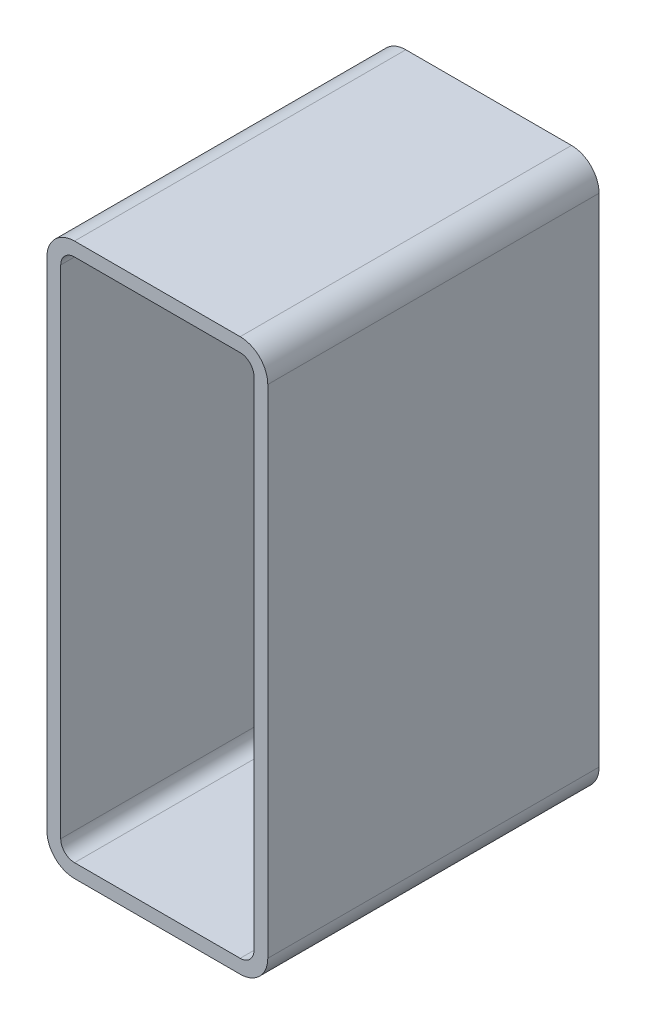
ISO-10303-21;
HEADER;
FILE_DESCRIPTION(('STEP AP214'),'2;1');
FILE_NAME('part.step','',(''),(''),'','','');
FILE_SCHEMA(('AUTOMOTIVE_DESIGN { 1 0 10303 214 1 1 1 1 }'));
ENDSEC;
DATA;
#1=APPLICATION_CONTEXT('core data for automotive mechanical design processes');
#2=APPLICATION_PROTOCOL_DEFINITION('international standard','automotive_design',2000,#1);
#3=PRODUCT_CONTEXT('',#1,'mechanical');
#4=PRODUCT('Part','Part','',(#3));
#5=PRODUCT_RELATED_PRODUCT_CATEGORY('part','',(#4));
#6=PRODUCT_DEFINITION_FORMATION('','',#4);
#7=PRODUCT_DEFINITION_CONTEXT('part definition',#1,'design');
#8=PRODUCT_DEFINITION('design','',#6,#7);
#9=PRODUCT_DEFINITION_SHAPE('','',#8);
#10=(LENGTH_UNIT() NAMED_UNIT(*) SI_UNIT(.MILLI.,.METRE.));
#11=(NAMED_UNIT(*) PLANE_ANGLE_UNIT() SI_UNIT($,.RADIAN.));
#12=(NAMED_UNIT(*) SI_UNIT($,.STERADIAN.) SOLID_ANGLE_UNIT());
#13=UNCERTAINTY_MEASURE_WITH_UNIT(LENGTH_MEASURE(1.E-05),#10,'distance_accuracy_value','');
#14=(GEOMETRIC_REPRESENTATION_CONTEXT(3) GLOBAL_UNCERTAINTY_ASSIGNED_CONTEXT((#13)) GLOBAL_UNIT_ASSIGNED_CONTEXT((#10,
#11,#12)) REPRESENTATION_CONTEXT('',''));
#15=CARTESIAN_POINT('',(0.,0.,0.));
#16=DIRECTION('',(0.,0.,1.));
#17=DIRECTION('',(1.,0.,0.));
#18=AXIS2_PLACEMENT_3D('',#15,#16,#17);
#19=CARTESIAN_POINT('',(179.190940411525,27.0912282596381,304.8));
#20=DIRECTION('',(0.,0.,1.));
#21=DIRECTION('',(1.,0.,0.));
#22=AXIS2_PLACEMENT_3D('',#19,#20,#21);
#23=PLANE('',#22);
#24=CARTESIAN_POINT('',(179.190940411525,27.0912282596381,304.8));
#25=DIRECTION('',(0.,0.,1.));
#26=DIRECTION('',(1.,0.,0.));
#27=AXIS2_PLACEMENT_3D('',#24,#25,#26);
#28=CIRCLE('',#27,25.4);
#29=CARTESIAN_POINT('',(179.190940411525,1.69122825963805,304.8));
#30=VERTEX_POINT('',#29);
#31=CARTESIAN_POINT('',(204.590940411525,27.0912282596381,304.8));
#32=VERTEX_POINT('',#31);
#33=EDGE_CURVE('E211',#30,#32,#28,.T.);
#34=ORIENTED_EDGE('',*,*,#33,.T.);
#35=DIRECTION('',(0.,1.,0.));
#36=VECTOR('',#35,1.);
#37=CARTESIAN_POINT('',(204.590940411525,484.291228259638,304.8));
#38=LINE('',#37,#36);
#39=CARTESIAN_POINT('',(204.590940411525,484.291228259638,304.8));
#40=VERTEX_POINT('',#39);
#41=EDGE_CURVE('E214',#32,#40,#38,.T.);
#42=ORIENTED_EDGE('',*,*,#41,.T.);
#43=CARTESIAN_POINT('',(179.190940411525,484.291228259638,304.8));
#44=DIRECTION('',(0.,0.,1.));
#45=DIRECTION('',(1.,0.,0.));
#46=AXIS2_PLACEMENT_3D('',#43,#44,#45);
#47=CIRCLE('',#46,25.3999999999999);
#48=CARTESIAN_POINT('',(179.190940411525,509.691228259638,304.8));
#49=VERTEX_POINT('',#48);
#50=EDGE_CURVE('E217',#40,#49,#47,.T.);
#51=ORIENTED_EDGE('',*,*,#50,.T.);
#52=DIRECTION('',(-1.,0.,0.));
#53=VECTOR('',#52,1.);
#54=CARTESIAN_POINT('',(26.7909404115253,509.691228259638,304.8));
#55=LINE('',#54,#53);
#56=CARTESIAN_POINT('',(26.7909404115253,509.691228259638,304.8));
#57=VERTEX_POINT('',#56);
#58=EDGE_CURVE('E219',#49,#57,#55,.T.);
#59=ORIENTED_EDGE('',*,*,#58,.T.);
#60=CARTESIAN_POINT('',(26.7909404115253,484.291228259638,304.8));
#61=DIRECTION('',(0.,0.,1.));
#62=DIRECTION('',(1.,0.,0.));
#63=AXIS2_PLACEMENT_3D('',#60,#61,#62);
#64=CIRCLE('',#63,25.3999999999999);
#65=CARTESIAN_POINT('',(1.3909404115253,484.291228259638,304.8));
#66=VERTEX_POINT('',#65);
#67=EDGE_CURVE('E221',#57,#66,#64,.T.);
#68=ORIENTED_EDGE('',*,*,#67,.T.);
#69=DIRECTION('',(0.,-1.,0.));
#70=VECTOR('',#69,1.);
#71=CARTESIAN_POINT('',(1.3909404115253,27.0912282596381,304.8));
#72=LINE('',#71,#70);
#73=CARTESIAN_POINT('',(1.3909404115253,27.0912282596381,304.8));
#74=VERTEX_POINT('',#73);
#75=EDGE_CURVE('E223',#66,#74,#72,.T.);
#76=ORIENTED_EDGE('',*,*,#75,.T.);
#77=CARTESIAN_POINT('',(26.7909404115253,27.0912282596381,304.8));
#78=DIRECTION('',(0.,0.,1.));
#79=DIRECTION('',(1.,0.,0.));
#80=AXIS2_PLACEMENT_3D('',#77,#78,#79);
#81=CIRCLE('',#80,25.4);
#82=CARTESIAN_POINT('',(26.7909404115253,1.69122825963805,304.8));
#83=VERTEX_POINT('',#82);
#84=EDGE_CURVE('E225',#74,#83,#81,.T.);
#85=ORIENTED_EDGE('',*,*,#84,.T.);
#86=DIRECTION('',(1.,0.,0.));
#87=VECTOR('',#86,1.);
#88=CARTESIAN_POINT('',(179.190940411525,1.69122825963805,304.8));
#89=LINE('',#88,#87);
#90=EDGE_CURVE('E227',#83,#30,#89,.T.);
#91=ORIENTED_EDGE('',*,*,#90,.T.);
#92=EDGE_LOOP('',(#34,#42,#51,#59,#68,#76,#85,#91));
#93=FACE_BOUND('',#92,.T.);
#94=DIRECTION('',(0.,-1.,0.));
#95=VECTOR('',#94,1.);
#96=CARTESIAN_POINT('',(14.0909404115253,27.0912282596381,304.8));
#97=LINE('',#96,#95);
#98=CARTESIAN_POINT('',(14.0909404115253,484.291228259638,304.8));
#99=VERTEX_POINT('',#98);
#100=CARTESIAN_POINT('',(14.0909404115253,27.0912282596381,304.8));
#101=VERTEX_POINT('',#100);
#102=EDGE_CURVE('E154',#99,#101,#97,.T.);
#103=ORIENTED_EDGE('',*,*,#102,.F.);
#104=CARTESIAN_POINT('',(26.7909404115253,484.291228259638,304.8));
#105=DIRECTION('',(0.,0.,1.));
#106=DIRECTION('',(1.,0.,0.));
#107=AXIS2_PLACEMENT_3D('',#104,#105,#106);
#108=CIRCLE('',#107,12.6999999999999);
#109=CARTESIAN_POINT('',(26.7909404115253,496.991228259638,304.8));
#110=VERTEX_POINT('',#109);
#111=EDGE_CURVE('E146',#110,#99,#108,.T.);
#112=ORIENTED_EDGE('',*,*,#111,.F.);
#113=DIRECTION('',(-1.,0.,0.));
#114=VECTOR('',#113,1.);
#115=CARTESIAN_POINT('',(26.7909404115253,496.991228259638,304.8));
#116=LINE('',#115,#114);
#117=CARTESIAN_POINT('',(179.190940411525,496.991228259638,304.8));
#118=VERTEX_POINT('',#117);
#119=EDGE_CURVE('E179',#118,#110,#116,.T.);
#120=ORIENTED_EDGE('',*,*,#119,.F.);
#121=CARTESIAN_POINT('',(179.190940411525,484.291228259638,304.8));
#122=DIRECTION('',(0.,0.,1.));
#123=DIRECTION('',(1.,0.,0.));
#124=AXIS2_PLACEMENT_3D('',#121,#122,#123);
#125=CIRCLE('',#124,12.6999999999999);
#126=CARTESIAN_POINT('',(191.890940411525,484.291228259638,304.8));
#127=VERTEX_POINT('',#126);
#128=EDGE_CURVE('E177',#127,#118,#125,.T.);
#129=ORIENTED_EDGE('',*,*,#128,.F.);
#130=DIRECTION('',(0.,1.,0.));
#131=VECTOR('',#130,1.);
#132=CARTESIAN_POINT('',(191.890940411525,484.291228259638,304.8));
#133=LINE('',#132,#131);
#134=CARTESIAN_POINT('',(191.890940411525,27.0912282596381,304.8));
#135=VERTEX_POINT('',#134);
#136=EDGE_CURVE('E175',#135,#127,#133,.T.);
#137=ORIENTED_EDGE('',*,*,#136,.F.);
#138=CARTESIAN_POINT('',(179.190940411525,27.0912282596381,304.8));
#139=DIRECTION('',(0.,0.,1.));
#140=DIRECTION('',(1.,0.,0.));
#141=AXIS2_PLACEMENT_3D('',#138,#139,#140);
#142=CIRCLE('',#141,12.7);
#143=CARTESIAN_POINT('',(179.190940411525,14.391228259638,304.8));
#144=VERTEX_POINT('',#143);
#145=EDGE_CURVE('E173',#144,#135,#142,.T.);
#146=ORIENTED_EDGE('',*,*,#145,.F.);
#147=DIRECTION('',(1.,0.,0.));
#148=VECTOR('',#147,1.);
#149=CARTESIAN_POINT('',(179.190940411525,14.391228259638,304.8));
#150=LINE('',#149,#148);
#151=CARTESIAN_POINT('',(26.7909404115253,14.391228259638,304.8));
#152=VERTEX_POINT('',#151);
#153=EDGE_CURVE('E169',#152,#144,#150,.T.);
#154=ORIENTED_EDGE('',*,*,#153,.F.);
#155=CARTESIAN_POINT('',(26.7909404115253,27.0912282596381,304.8));
#156=DIRECTION('',(0.,0.,1.));
#157=DIRECTION('',(1.,0.,0.));
#158=AXIS2_PLACEMENT_3D('',#155,#156,#157);
#159=CIRCLE('',#158,12.7);
#160=EDGE_CURVE('E167',#101,#152,#159,.T.);
#161=ORIENTED_EDGE('',*,*,#160,.F.);
#162=EDGE_LOOP('',(#103,#112,#120,#129,#137,#146,#154,#161));
#163=FACE_BOUND('',#162,.T.);
#164=ADVANCED_FACE('F33',(#93,#163),#23,.T.);
#165=CARTESIAN_POINT('',(179.190940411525,27.0912282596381,0.));
#166=DIRECTION('',(0.,0.,1.));
#167=DIRECTION('',(1.,0.,0.));
#168=AXIS2_PLACEMENT_3D('',#165,#166,#167);
#169=PLANE('',#168);
#170=CARTESIAN_POINT('',(179.190940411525,27.0912282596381,0.));
#171=DIRECTION('',(0.,0.,1.));
#172=DIRECTION('',(1.,0.,0.));
#173=AXIS2_PLACEMENT_3D('',#170,#171,#172);
#174=CIRCLE('',#173,25.4);
#175=CARTESIAN_POINT('',(179.190940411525,1.69122825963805,0.));
#176=VERTEX_POINT('',#175);
#177=CARTESIAN_POINT('',(204.590940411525,27.0912282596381,0.));
#178=VERTEX_POINT('',#177);
#179=EDGE_CURVE('E162',#176,#178,#174,.T.);
#180=ORIENTED_EDGE('',*,*,#179,.F.);
#181=DIRECTION('',(1.,0.,0.));
#182=VECTOR('',#181,1.);
#183=CARTESIAN_POINT('',(179.190940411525,1.69122825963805,0.));
#184=LINE('',#183,#182);
#185=CARTESIAN_POINT('',(26.7909404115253,1.69122825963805,0.));
#186=VERTEX_POINT('',#185);
#187=EDGE_CURVE('E215',#186,#176,#184,.T.);
#188=ORIENTED_EDGE('',*,*,#187,.F.);
#189=CARTESIAN_POINT('',(26.7909404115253,27.0912282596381,0.));
#190=DIRECTION('',(0.,0.,1.));
#191=DIRECTION('',(1.,0.,0.));
#192=AXIS2_PLACEMENT_3D('',#189,#190,#191);
#193=CIRCLE('',#192,25.4);
#194=CARTESIAN_POINT('',(1.3909404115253,27.0912282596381,0.));
#195=VERTEX_POINT('',#194);
#196=EDGE_CURVE('E242',#195,#186,#193,.T.);
#197=ORIENTED_EDGE('',*,*,#196,.F.);
#198=DIRECTION('',(0.,-1.,0.));
#199=VECTOR('',#198,1.);
#200=CARTESIAN_POINT('',(1.3909404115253,27.0912282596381,0.));
#201=LINE('',#200,#199);
#202=CARTESIAN_POINT('',(1.3909404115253,484.291228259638,0.));
#203=VERTEX_POINT('',#202);
#204=EDGE_CURVE('E240',#203,#195,#201,.T.);
#205=ORIENTED_EDGE('',*,*,#204,.F.);
#206=CARTESIAN_POINT('',(26.7909404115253,484.291228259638,0.));
#207=DIRECTION('',(0.,0.,1.));
#208=DIRECTION('',(1.,0.,0.));
#209=AXIS2_PLACEMENT_3D('',#206,#207,#208);
#210=CIRCLE('',#209,25.3999999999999);
#211=CARTESIAN_POINT('',(26.7909404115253,509.691228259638,0.));
#212=VERTEX_POINT('',#211);
#213=EDGE_CURVE('E238',#212,#203,#210,.T.);
#214=ORIENTED_EDGE('',*,*,#213,.F.);
#215=DIRECTION('',(-1.,0.,0.));
#216=VECTOR('',#215,1.);
#217=CARTESIAN_POINT('',(26.7909404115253,509.691228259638,0.));
#218=LINE('',#217,#216);
#219=CARTESIAN_POINT('',(179.190940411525,509.691228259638,0.));
#220=VERTEX_POINT('',#219);
#221=EDGE_CURVE('E236',#220,#212,#218,.T.);
#222=ORIENTED_EDGE('',*,*,#221,.F.);
#223=CARTESIAN_POINT('',(179.190940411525,484.291228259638,0.));
#224=DIRECTION('',(0.,0.,1.));
#225=DIRECTION('',(1.,0.,0.));
#226=AXIS2_PLACEMENT_3D('',#223,#224,#225);
#227=CIRCLE('',#226,25.3999999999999);
#228=CARTESIAN_POINT('',(204.590940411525,484.291228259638,0.));
#229=VERTEX_POINT('',#228);
#230=EDGE_CURVE('E234',#229,#220,#227,.T.);
#231=ORIENTED_EDGE('',*,*,#230,.F.);
#232=DIRECTION('',(0.,1.,0.));
#233=VECTOR('',#232,1.);
#234=CARTESIAN_POINT('',(204.590940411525,484.291228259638,0.));
#235=LINE('',#234,#233);
#236=EDGE_CURVE('E232',#178,#229,#235,.T.);
#237=ORIENTED_EDGE('',*,*,#236,.F.);
#238=EDGE_LOOP('',(#180,#188,#197,#205,#214,#222,#231,#237));
#239=FACE_BOUND('',#238,.T.);
#240=CARTESIAN_POINT('',(26.7909404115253,484.291228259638,0.));
#241=DIRECTION('',(0.,0.,1.));
#242=DIRECTION('',(1.,0.,0.));
#243=AXIS2_PLACEMENT_3D('',#240,#241,#242);
#244=CIRCLE('',#243,12.6999999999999);
#245=CARTESIAN_POINT('',(26.7909404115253,496.991228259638,0.));
#246=VERTEX_POINT('',#245);
#247=CARTESIAN_POINT('',(14.0909404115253,484.291228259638,0.));
#248=VERTEX_POINT('',#247);
#249=EDGE_CURVE('E56',#246,#248,#244,.T.);
#250=ORIENTED_EDGE('',*,*,#249,.T.);
#251=DIRECTION('',(0.,-1.,0.));
#252=VECTOR('',#251,1.);
#253=CARTESIAN_POINT('',(14.0909404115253,27.0912282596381,0.));
#254=LINE('',#253,#252);
#255=CARTESIAN_POINT('',(14.0909404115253,27.0912282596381,0.));
#256=VERTEX_POINT('',#255);
#257=EDGE_CURVE('E161',#248,#256,#254,.T.);
#258=ORIENTED_EDGE('',*,*,#257,.T.);
#259=CARTESIAN_POINT('',(26.7909404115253,27.0912282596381,0.));
#260=DIRECTION('',(0.,0.,1.));
#261=DIRECTION('',(1.,0.,0.));
#262=AXIS2_PLACEMENT_3D('',#259,#260,#261);
#263=CIRCLE('',#262,12.7);
#264=CARTESIAN_POINT('',(26.7909404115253,14.391228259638,0.));
#265=VERTEX_POINT('',#264);
#266=EDGE_CURVE('E183',#256,#265,#263,.T.);
#267=ORIENTED_EDGE('',*,*,#266,.T.);
#268=DIRECTION('',(1.,0.,0.));
#269=VECTOR('',#268,1.);
#270=CARTESIAN_POINT('',(179.190940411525,14.391228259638,0.));
#271=LINE('',#270,#269);
#272=CARTESIAN_POINT('',(179.190940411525,14.391228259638,0.));
#273=VERTEX_POINT('',#272);
#274=EDGE_CURVE('E186',#265,#273,#271,.T.);
#275=ORIENTED_EDGE('',*,*,#274,.T.);
#276=CARTESIAN_POINT('',(179.190940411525,27.0912282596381,0.));
#277=DIRECTION('',(0.,0.,1.));
#278=DIRECTION('',(1.,0.,0.));
#279=AXIS2_PLACEMENT_3D('',#276,#277,#278);
#280=CIRCLE('',#279,12.7);
#281=CARTESIAN_POINT('',(191.890940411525,27.0912282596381,0.));
#282=VERTEX_POINT('',#281);
#283=EDGE_CURVE('E189',#273,#282,#280,.T.);
#284=ORIENTED_EDGE('',*,*,#283,.T.);
#285=DIRECTION('',(0.,1.,0.));
#286=VECTOR('',#285,1.);
#287=CARTESIAN_POINT('',(191.890940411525,484.291228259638,0.));
#288=LINE('',#287,#286);
#289=CARTESIAN_POINT('',(191.890940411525,484.291228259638,0.));
#290=VERTEX_POINT('',#289);
#291=EDGE_CURVE('E192',#282,#290,#288,.T.);
#292=ORIENTED_EDGE('',*,*,#291,.T.);
#293=CARTESIAN_POINT('',(179.190940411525,484.291228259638,0.));
#294=DIRECTION('',(0.,0.,1.));
#295=DIRECTION('',(1.,0.,0.));
#296=AXIS2_PLACEMENT_3D('',#293,#294,#295);
#297=CIRCLE('',#296,12.6999999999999);
#298=CARTESIAN_POINT('',(179.190940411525,496.991228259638,0.));
#299=VERTEX_POINT('',#298);
#300=EDGE_CURVE('E195',#290,#299,#297,.T.);
#301=ORIENTED_EDGE('',*,*,#300,.T.);
#302=DIRECTION('',(-1.,0.,0.));
#303=VECTOR('',#302,1.);
#304=CARTESIAN_POINT('',(26.7909404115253,496.991228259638,0.));
#305=LINE('',#304,#303);
#306=EDGE_CURVE('E155',#299,#246,#305,.T.);
#307=ORIENTED_EDGE('',*,*,#306,.T.);
#308=EDGE_LOOP('',(#250,#258,#267,#275,#284,#292,#301,#307));
#309=FACE_BOUND('',#308,.T.);
#310=ADVANCED_FACE('F272',(#239,#309),#169,.F.);
#311=CARTESIAN_POINT('',(179.190940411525,27.0912282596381,304.8));
#312=DIRECTION('',(0.,0.,-1.));
#313=DIRECTION('',(-1.,0.,0.));
#314=AXIS2_PLACEMENT_3D('',#311,#312,#313);
#315=CYLINDRICAL_SURFACE('',#314,25.4);
#316=ORIENTED_EDGE('',*,*,#179,.T.);
#317=DIRECTION('',(0.,0.,-1.));
#318=VECTOR('',#317,1.);
#319=CARTESIAN_POINT('',(204.590940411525,27.0912282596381,304.8));
#320=LINE('',#319,#318);
#321=EDGE_CURVE('E11',#32,#178,#320,.T.);
#322=ORIENTED_EDGE('',*,*,#321,.F.);
#323=ORIENTED_EDGE('',*,*,#33,.F.);
#324=DIRECTION('',(0.,0.,-1.));
#325=VECTOR('',#324,1.);
#326=CARTESIAN_POINT('',(179.190940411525,1.69122825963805,304.8));
#327=LINE('',#326,#325);
#328=EDGE_CURVE('E229',#30,#176,#327,.T.);
#329=ORIENTED_EDGE('',*,*,#328,.T.);
#330=EDGE_LOOP('',(#316,#322,#323,#329));
#331=FACE_BOUND('',#330,.T.);
#332=ADVANCED_FACE('F35',(#331),#315,.T.);
#333=CARTESIAN_POINT('',(204.590940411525,484.291228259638,304.8));
#334=DIRECTION('',(-1.,0.,0.));
#335=DIRECTION('',(0.,0.,1.));
#336=AXIS2_PLACEMENT_3D('',#333,#334,#335);
#337=PLANE('',#336);
#338=ORIENTED_EDGE('',*,*,#236,.T.);
#339=DIRECTION('',(0.,0.,-1.));
#340=VECTOR('',#339,1.);
#341=CARTESIAN_POINT('',(204.590940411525,484.291228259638,304.8));
#342=LINE('',#341,#340);
#343=EDGE_CURVE('E41',#40,#229,#342,.T.);
#344=ORIENTED_EDGE('',*,*,#343,.F.);
#345=ORIENTED_EDGE('',*,*,#41,.F.);
#346=ORIENTED_EDGE('',*,*,#321,.T.);
#347=EDGE_LOOP('',(#338,#344,#345,#346));
#348=FACE_BOUND('',#347,.T.);
#349=ADVANCED_FACE('F289',(#348),#337,.F.);
#350=CARTESIAN_POINT('',(179.190940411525,484.291228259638,304.8));
#351=DIRECTION('',(0.,0.,-1.));
#352=DIRECTION('',(-1.,0.,0.));
#353=AXIS2_PLACEMENT_3D('',#350,#351,#352);
#354=CYLINDRICAL_SURFACE('',#353,25.3999999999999);
#355=ORIENTED_EDGE('',*,*,#230,.T.);
#356=DIRECTION('',(0.,0.,-1.));
#357=VECTOR('',#356,1.);
#358=CARTESIAN_POINT('',(179.190940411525,509.691228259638,304.8));
#359=LINE('',#358,#357);
#360=EDGE_CURVE('E259',#49,#220,#359,.T.);
#361=ORIENTED_EDGE('',*,*,#360,.F.);
#362=ORIENTED_EDGE('',*,*,#50,.F.);
#363=ORIENTED_EDGE('',*,*,#343,.T.);
#364=EDGE_LOOP('',(#355,#361,#362,#363));
#365=FACE_BOUND('',#364,.T.);
#366=ADVANCED_FACE('F266',(#365),#354,.T.);
#367=CARTESIAN_POINT('',(26.7909404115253,509.691228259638,304.8));
#368=DIRECTION('',(0.,-1.,0.));
#369=DIRECTION('',(0.,0.,-1.));
#370=AXIS2_PLACEMENT_3D('',#367,#368,#369);
#371=PLANE('',#370);
#372=ORIENTED_EDGE('',*,*,#221,.T.);
#373=DIRECTION('',(0.,0.,-1.));
#374=VECTOR('',#373,1.);
#375=CARTESIAN_POINT('',(26.7909404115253,509.691228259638,304.8));
#376=LINE('',#375,#374);
#377=EDGE_CURVE('E256',#57,#212,#376,.T.);
#378=ORIENTED_EDGE('',*,*,#377,.F.);
#379=ORIENTED_EDGE('',*,*,#58,.F.);
#380=ORIENTED_EDGE('',*,*,#360,.T.);
#381=EDGE_LOOP('',(#372,#378,#379,#380));
#382=FACE_BOUND('',#381,.T.);
#383=ADVANCED_FACE('F278',(#382),#371,.F.);
#384=CARTESIAN_POINT('',(26.7909404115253,484.291228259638,304.8));
#385=DIRECTION('',(0.,0.,-1.));
#386=DIRECTION('',(-1.,0.,0.));
#387=AXIS2_PLACEMENT_3D('',#384,#385,#386);
#388=CYLINDRICAL_SURFACE('',#387,25.3999999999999);
#389=ORIENTED_EDGE('',*,*,#213,.T.);
#390=DIRECTION('',(0.,0.,-1.));
#391=VECTOR('',#390,1.);
#392=CARTESIAN_POINT('',(1.3909404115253,484.291228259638,304.8));
#393=LINE('',#392,#391);
#394=EDGE_CURVE('E253',#66,#203,#393,.T.);
#395=ORIENTED_EDGE('',*,*,#394,.F.);
#396=ORIENTED_EDGE('',*,*,#67,.F.);
#397=ORIENTED_EDGE('',*,*,#377,.T.);
#398=EDGE_LOOP('',(#389,#395,#396,#397));
#399=FACE_BOUND('',#398,.T.);
#400=ADVANCED_FACE('F282',(#399),#388,.T.);
#401=CARTESIAN_POINT('',(1.3909404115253,27.0912282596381,304.8));
#402=DIRECTION('',(1.,0.,0.));
#403=DIRECTION('',(0.,0.,-1.));
#404=AXIS2_PLACEMENT_3D('',#401,#402,#403);
#405=PLANE('',#404);
#406=ORIENTED_EDGE('',*,*,#204,.T.);
#407=DIRECTION('',(0.,0.,-1.));
#408=VECTOR('',#407,1.);
#409=CARTESIAN_POINT('',(1.3909404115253,27.0912282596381,304.8));
#410=LINE('',#409,#408);
#411=EDGE_CURVE('E250',#74,#195,#410,.T.);
#412=ORIENTED_EDGE('',*,*,#411,.F.);
#413=ORIENTED_EDGE('',*,*,#75,.F.);
#414=ORIENTED_EDGE('',*,*,#394,.T.);
#415=EDGE_LOOP('',(#406,#412,#413,#414));
#416=FACE_BOUND('',#415,.T.);
#417=ADVANCED_FACE('F302',(#416),#405,.F.);
#418=CARTESIAN_POINT('',(26.7909404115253,27.0912282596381,304.8));
#419=DIRECTION('',(0.,0.,-1.));
#420=DIRECTION('',(-1.,0.,0.));
#421=AXIS2_PLACEMENT_3D('',#418,#419,#420);
#422=CYLINDRICAL_SURFACE('',#421,25.4);
#423=ORIENTED_EDGE('',*,*,#196,.T.);
#424=DIRECTION('',(0.,0.,-1.));
#425=VECTOR('',#424,1.);
#426=CARTESIAN_POINT('',(26.7909404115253,1.69122825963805,304.8));
#427=LINE('',#426,#425);
#428=EDGE_CURVE('E247',#83,#186,#427,.T.);
#429=ORIENTED_EDGE('',*,*,#428,.F.);
#430=ORIENTED_EDGE('',*,*,#84,.F.);
#431=ORIENTED_EDGE('',*,*,#411,.T.);
#432=EDGE_LOOP('',(#423,#429,#430,#431));
#433=FACE_BOUND('',#432,.T.);
#434=ADVANCED_FACE('F300',(#433),#422,.T.);
#435=CARTESIAN_POINT('',(179.190940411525,1.69122825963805,304.8));
#436=DIRECTION('',(0.,1.,0.));
#437=DIRECTION('',(0.,0.,1.));
#438=AXIS2_PLACEMENT_3D('',#435,#436,#437);
#439=PLANE('',#438);
#440=ORIENTED_EDGE('',*,*,#187,.T.);
#441=ORIENTED_EDGE('',*,*,#328,.F.);
#442=ORIENTED_EDGE('',*,*,#90,.F.);
#443=ORIENTED_EDGE('',*,*,#428,.T.);
#444=EDGE_LOOP('',(#440,#441,#442,#443));
#445=FACE_BOUND('',#444,.T.);
#446=ADVANCED_FACE('F295',(#445),#439,.F.);
#447=CARTESIAN_POINT('',(26.7909404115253,484.291228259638,304.8));
#448=DIRECTION('',(0.,0.,-1.));
#449=DIRECTION('',(-1.,0.,0.));
#450=AXIS2_PLACEMENT_3D('',#447,#448,#449);
#451=CYLINDRICAL_SURFACE('',#450,12.6999999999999);
#452=ORIENTED_EDGE('',*,*,#249,.F.);
#453=DIRECTION('',(0.,0.,-1.));
#454=VECTOR('',#453,1.);
#455=CARTESIAN_POINT('',(26.7909404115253,496.991228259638,304.8));
#456=LINE('',#455,#454);
#457=EDGE_CURVE('E150',#110,#246,#456,.T.);
#458=ORIENTED_EDGE('',*,*,#457,.F.);
#459=ORIENTED_EDGE('',*,*,#111,.T.);
#460=DIRECTION('',(0.,0.,-1.));
#461=VECTOR('',#460,1.);
#462=CARTESIAN_POINT('',(14.0909404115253,484.291228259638,304.8));
#463=LINE('',#462,#461);
#464=EDGE_CURVE('E149',#99,#248,#463,.T.);
#465=ORIENTED_EDGE('',*,*,#464,.T.);
#466=EDGE_LOOP('',(#452,#458,#459,#465));
#467=FACE_BOUND('',#466,.T.);
#468=ADVANCED_FACE('F148',(#467),#451,.F.);
#469=CARTESIAN_POINT('',(14.0909404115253,27.0912282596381,304.8));
#470=DIRECTION('',(1.,0.,0.));
#471=DIRECTION('',(0.,0.,-1.));
#472=AXIS2_PLACEMENT_3D('',#469,#470,#471);
#473=PLANE('',#472);
#474=ORIENTED_EDGE('',*,*,#257,.F.);
#475=ORIENTED_EDGE('',*,*,#464,.F.);
#476=ORIENTED_EDGE('',*,*,#102,.T.);
#477=DIRECTION('',(0.,0.,-1.));
#478=VECTOR('',#477,1.);
#479=CARTESIAN_POINT('',(14.0909404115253,27.0912282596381,304.8));
#480=LINE('',#479,#478);
#481=EDGE_CURVE('E163',#101,#256,#480,.T.);
#482=ORIENTED_EDGE('',*,*,#481,.T.);
#483=EDGE_LOOP('',(#474,#475,#476,#482));
#484=FACE_BOUND('',#483,.T.);
#485=ADVANCED_FACE('F158',(#484),#473,.T.);
#486=CARTESIAN_POINT('',(26.7909404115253,27.0912282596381,304.8));
#487=DIRECTION('',(0.,0.,-1.));
#488=DIRECTION('',(-1.,0.,0.));
#489=AXIS2_PLACEMENT_3D('',#486,#487,#488);
#490=CYLINDRICAL_SURFACE('',#489,12.7);
#491=ORIENTED_EDGE('',*,*,#266,.F.);
#492=ORIENTED_EDGE('',*,*,#481,.F.);
#493=ORIENTED_EDGE('',*,*,#160,.T.);
#494=DIRECTION('',(0.,0.,-1.));
#495=VECTOR('',#494,1.);
#496=CARTESIAN_POINT('',(26.7909404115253,14.391228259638,304.8));
#497=LINE('',#496,#495);
#498=EDGE_CURVE('E208',#152,#265,#497,.T.);
#499=ORIENTED_EDGE('',*,*,#498,.T.);
#500=EDGE_LOOP('',(#491,#492,#493,#499));
#501=FACE_BOUND('',#500,.T.);
#502=ADVANCED_FACE('F327',(#501),#490,.F.);
#503=CARTESIAN_POINT('',(179.190940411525,14.391228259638,304.8));
#504=DIRECTION('',(0.,1.,0.));
#505=DIRECTION('',(0.,0.,1.));
#506=AXIS2_PLACEMENT_3D('',#503,#504,#505);
#507=PLANE('',#506);
#508=ORIENTED_EDGE('',*,*,#274,.F.);
#509=ORIENTED_EDGE('',*,*,#498,.F.);
#510=ORIENTED_EDGE('',*,*,#153,.T.);
#511=DIRECTION('',(0.,0.,-1.));
#512=VECTOR('',#511,1.);
#513=CARTESIAN_POINT('',(179.190940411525,14.391228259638,304.8));
#514=LINE('',#513,#512);
#515=EDGE_CURVE('E206',#144,#273,#514,.T.);
#516=ORIENTED_EDGE('',*,*,#515,.T.);
#517=EDGE_LOOP('',(#508,#509,#510,#516));
#518=FACE_BOUND('',#517,.T.);
#519=ADVANCED_FACE('F331',(#518),#507,.T.);
#520=CARTESIAN_POINT('',(179.190940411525,27.0912282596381,304.8));
#521=DIRECTION('',(0.,0.,-1.));
#522=DIRECTION('',(-1.,0.,0.));
#523=AXIS2_PLACEMENT_3D('',#520,#521,#522);
#524=CYLINDRICAL_SURFACE('',#523,12.7);
#525=ORIENTED_EDGE('',*,*,#283,.F.);
#526=ORIENTED_EDGE('',*,*,#515,.F.);
#527=ORIENTED_EDGE('',*,*,#145,.T.);
#528=DIRECTION('',(0.,0.,-1.));
#529=VECTOR('',#528,1.);
#530=CARTESIAN_POINT('',(191.890940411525,27.0912282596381,304.8));
#531=LINE('',#530,#529);
#532=EDGE_CURVE('E204',#135,#282,#531,.T.);
#533=ORIENTED_EDGE('',*,*,#532,.T.);
#534=EDGE_LOOP('',(#525,#526,#527,#533));
#535=FACE_BOUND('',#534,.T.);
#536=ADVANCED_FACE('F337',(#535),#524,.F.);
#537=CARTESIAN_POINT('',(191.890940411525,484.291228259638,304.8));
#538=DIRECTION('',(-1.,0.,0.));
#539=DIRECTION('',(0.,0.,1.));
#540=AXIS2_PLACEMENT_3D('',#537,#538,#539);
#541=PLANE('',#540);
#542=ORIENTED_EDGE('',*,*,#291,.F.);
#543=ORIENTED_EDGE('',*,*,#532,.F.);
#544=ORIENTED_EDGE('',*,*,#136,.T.);
#545=DIRECTION('',(0.,0.,-1.));
#546=VECTOR('',#545,1.);
#547=CARTESIAN_POINT('',(191.890940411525,484.291228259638,304.8));
#548=LINE('',#547,#546);
#549=EDGE_CURVE('E202',#127,#290,#548,.T.);
#550=ORIENTED_EDGE('',*,*,#549,.T.);
#551=EDGE_LOOP('',(#542,#543,#544,#550));
#552=FACE_BOUND('',#551,.T.);
#553=ADVANCED_FACE('F341',(#552),#541,.T.);
#554=CARTESIAN_POINT('',(179.190940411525,484.291228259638,304.8));
#555=DIRECTION('',(0.,0.,-1.));
#556=DIRECTION('',(-1.,0.,0.));
#557=AXIS2_PLACEMENT_3D('',#554,#555,#556);
#558=CYLINDRICAL_SURFACE('',#557,12.6999999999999);
#559=ORIENTED_EDGE('',*,*,#300,.F.);
#560=ORIENTED_EDGE('',*,*,#549,.F.);
#561=ORIENTED_EDGE('',*,*,#128,.T.);
#562=DIRECTION('',(0.,0.,-1.));
#563=VECTOR('',#562,1.);
#564=CARTESIAN_POINT('',(179.190940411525,496.991228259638,304.8));
#565=LINE('',#564,#563);
#566=EDGE_CURVE('E48',#118,#299,#565,.T.);
#567=ORIENTED_EDGE('',*,*,#566,.T.);
#568=EDGE_LOOP('',(#559,#560,#561,#567));
#569=FACE_BOUND('',#568,.T.);
#570=ADVANCED_FACE('F345',(#569),#558,.F.);
#571=CARTESIAN_POINT('',(26.7909404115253,496.991228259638,304.8));
#572=DIRECTION('',(0.,-1.,0.));
#573=DIRECTION('',(0.,0.,-1.));
#574=AXIS2_PLACEMENT_3D('',#571,#572,#573);
#575=PLANE('',#574);
#576=ORIENTED_EDGE('',*,*,#306,.F.);
#577=ORIENTED_EDGE('',*,*,#566,.F.);
#578=ORIENTED_EDGE('',*,*,#119,.T.);
#579=ORIENTED_EDGE('',*,*,#457,.T.);
#580=EDGE_LOOP('',(#576,#577,#578,#579));
#581=FACE_BOUND('',#580,.T.);
#582=ADVANCED_FACE('F349',(#581),#575,.T.);
#583=CLOSED_SHELL('',(#164,#310,#332,#349,#366,#383,#400,#417,#434,#446,#468,#485,#502,#519,
#536,#553,#570,#582));
#584=MANIFOLD_SOLID_BREP('B2',#583);
#585=ADVANCED_BREP_SHAPE_REPRESENTATION('',(#18,#584),#14);
#586=SHAPE_DEFINITION_REPRESENTATION(#9,#585);
ENDSEC;
END-ISO-10303-21;
